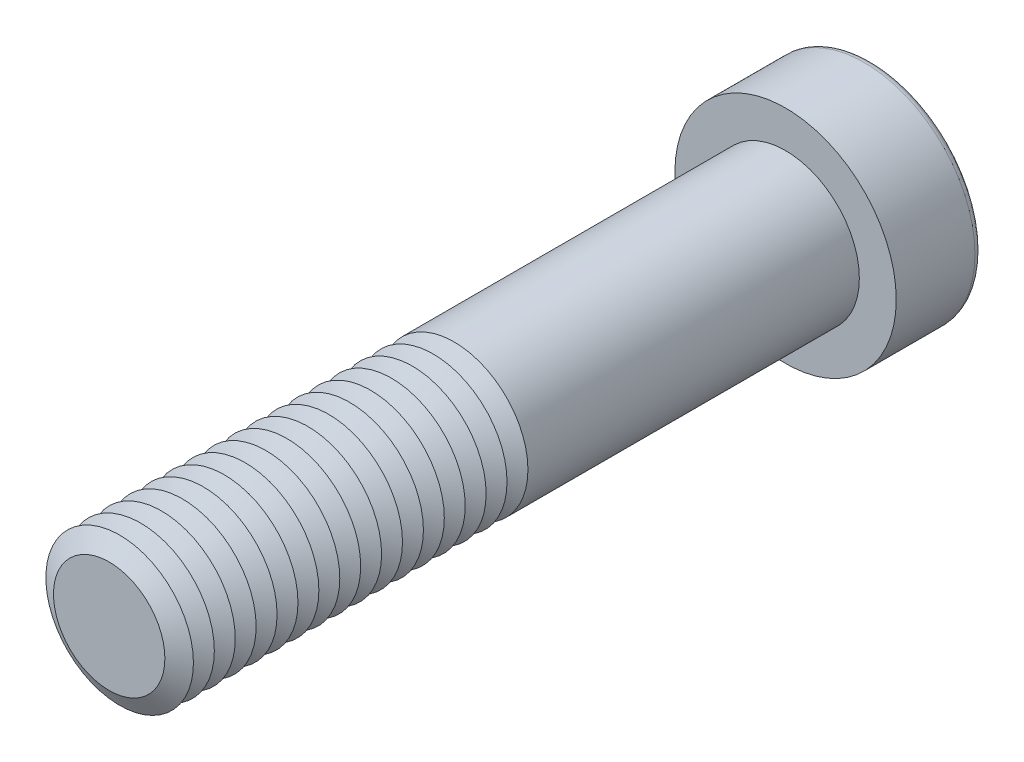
ISO-10303-21;
HEADER;
FILE_DESCRIPTION(('STEP AP214'),'2;1');
FILE_NAME('part.step','',(''),(''),'','','');
FILE_SCHEMA(('AUTOMOTIVE_DESIGN { 1 0 10303 214 1 1 1 1 }'));
ENDSEC;
DATA;
#1=APPLICATION_CONTEXT('core data for automotive mechanical design processes');
#2=APPLICATION_PROTOCOL_DEFINITION('international standard','automotive_design',2000,#1);
#3=PRODUCT_CONTEXT('',#1,'mechanical');
#4=PRODUCT('Part','Part','',(#3));
#5=PRODUCT_RELATED_PRODUCT_CATEGORY('part','',(#4));
#6=PRODUCT_DEFINITION_FORMATION('','',#4);
#7=PRODUCT_DEFINITION_CONTEXT('part definition',#1,'design');
#8=PRODUCT_DEFINITION('design','',#6,#7);
#9=PRODUCT_DEFINITION_SHAPE('','',#8);
#10=(LENGTH_UNIT() NAMED_UNIT(*) SI_UNIT(.MILLI.,.METRE.));
#11=(NAMED_UNIT(*) PLANE_ANGLE_UNIT() SI_UNIT($,.RADIAN.));
#12=(NAMED_UNIT(*) SI_UNIT($,.STERADIAN.) SOLID_ANGLE_UNIT());
#13=UNCERTAINTY_MEASURE_WITH_UNIT(LENGTH_MEASURE(1.E-05),#10,'distance_accuracy_value','');
#14=(GEOMETRIC_REPRESENTATION_CONTEXT(3) GLOBAL_UNCERTAINTY_ASSIGNED_CONTEXT((#13)) GLOBAL_UNIT_ASSIGNED_CONTEXT((#10,
#11,#12)) REPRESENTATION_CONTEXT('',''));
#15=CARTESIAN_POINT('',(0.,0.,0.));
#16=DIRECTION('',(0.,0.,1.));
#17=DIRECTION('',(1.,0.,0.));
#18=AXIS2_PLACEMENT_3D('',#15,#16,#17);
#19=CARTESIAN_POINT('',(0.,0.,49.05));
#20=DIRECTION('',(0.,0.,1.));
#21=DIRECTION('',(1.,0.,0.));
#22=AXIS2_PLACEMENT_3D('',#19,#20,#21);
#23=CONICAL_SURFACE('',#22,6.,1.0471975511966);
#24=CARTESIAN_POINT('',(0.,0.,48.2));
#25=DIRECTION('',(0.,0.,1.));
#26=DIRECTION('',(1.,0.,0.));
#27=AXIS2_PLACEMENT_3D('',#24,#25,#26);
#28=CIRCLE('',#27,4.52775681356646);
#29=CARTESIAN_POINT('',(4.52775681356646,0.,48.2));
#30=VERTEX_POINT('',#29);
#31=EDGE_CURVE('E313',#30,#30,#28,.T.);
#32=ORIENTED_EDGE('',*,*,#31,.T.);
#33=EDGE_LOOP('',(#32));
#34=FACE_BOUND('',#33,.T.);
#35=CARTESIAN_POINT('',(0.,0.,49.05));
#36=DIRECTION('',(0.,0.,1.));
#37=DIRECTION('',(1.,0.,0.));
#38=AXIS2_PLACEMENT_3D('',#35,#36,#37);
#39=CIRCLE('',#38,6.);
#40=CARTESIAN_POINT('',(6.,0.,49.05));
#41=VERTEX_POINT('',#40);
#42=EDGE_CURVE('E316',#41,#41,#39,.T.);
#43=ORIENTED_EDGE('',*,*,#42,.F.);
#44=EDGE_LOOP('',(#43));
#45=FACE_BOUND('',#44,.T.);
#46=ADVANCED_FACE('F39',(#34,#45),#23,.T.);
#47=CARTESIAN_POINT('',(0.,0.,48.2));
#48=DIRECTION('',(0.,0.,-1.));
#49=DIRECTION('',(-1.,0.,0.));
#50=AXIS2_PLACEMENT_3D('',#47,#48,#49);
#51=CONICAL_SURFACE('',#50,4.52775681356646,1.0471975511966);
#52=CARTESIAN_POINT('',(0.,0.,47.35));
#53=DIRECTION('',(0.,0.,1.));
#54=DIRECTION('',(1.,0.,0.));
#55=AXIS2_PLACEMENT_3D('',#52,#53,#54);
#56=CIRCLE('',#55,6.);
#57=CARTESIAN_POINT('',(6.,0.,47.35));
#58=VERTEX_POINT('',#57);
#59=EDGE_CURVE('E324',#58,#58,#56,.T.);
#60=ORIENTED_EDGE('',*,*,#59,.T.);
#61=EDGE_LOOP('',(#60));
#62=FACE_BOUND('',#61,.T.);
#63=ORIENTED_EDGE('',*,*,#31,.F.);
#64=EDGE_LOOP('',(#63));
#65=FACE_BOUND('',#64,.T.);
#66=ADVANCED_FACE('F244',(#62,#65),#51,.T.);
#67=CARTESIAN_POINT('',(0.,0.,55.));
#68=DIRECTION('',(0.,0.,1.));
#69=DIRECTION('',(1.,0.,0.));
#70=AXIS2_PLACEMENT_3D('',#67,#68,#69);
#71=PLANE('',#70);
#72=CARTESIAN_POINT('',(0.,0.,55.));
#73=DIRECTION('',(0.,0.,1.));
#74=DIRECTION('',(1.,0.,0.));
#75=AXIS2_PLACEMENT_3D('',#72,#73,#74);
#76=CIRCLE('',#75,4.52775681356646);
#77=CARTESIAN_POINT('',(4.52775681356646,0.,55.));
#78=VERTEX_POINT('',#77);
#79=EDGE_CURVE('E173',#78,#78,#76,.T.);
#80=ORIENTED_EDGE('',*,*,#79,.T.);
#81=EDGE_LOOP('',(#80));
#82=FACE_BOUND('',#81,.T.);
#83=ADVANCED_FACE('F250',(#82),#71,.T.);
#84=CARTESIAN_POINT('',(0.,0.,55.));
#85=DIRECTION('',(0.,0.,-1.));
#86=DIRECTION('',(-1.,0.,0.));
#87=AXIS2_PLACEMENT_3D('',#84,#85,#86);
#88=CONICAL_SURFACE('',#87,4.52775681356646,1.0471975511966);
#89=CARTESIAN_POINT('',(0.,0.,54.15));
#90=DIRECTION('',(0.,0.,1.));
#91=DIRECTION('',(1.,0.,0.));
#92=AXIS2_PLACEMENT_3D('',#89,#90,#91);
#93=CIRCLE('',#92,6.);
#94=CARTESIAN_POINT('',(6.,0.,54.15));
#95=VERTEX_POINT('',#94);
#96=EDGE_CURVE('E290',#95,#95,#93,.T.);
#97=ORIENTED_EDGE('',*,*,#96,.T.);
#98=EDGE_LOOP('',(#97));
#99=FACE_BOUND('',#98,.T.);
#100=ORIENTED_EDGE('',*,*,#79,.F.);
#101=EDGE_LOOP('',(#100));
#102=FACE_BOUND('',#101,.T.);
#103=ADVANCED_FACE('F198',(#99,#102),#88,.T.);
#104=CARTESIAN_POINT('',(0.,0.,54.15));
#105=DIRECTION('',(0.,0.,1.));
#106=DIRECTION('',(1.,0.,0.));
#107=AXIS2_PLACEMENT_3D('',#104,#105,#106);
#108=CONICAL_SURFACE('',#107,6.,1.0471975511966);
#109=CARTESIAN_POINT('',(0.,0.,53.3));
#110=DIRECTION('',(0.,0.,1.));
#111=DIRECTION('',(1.,0.,0.));
#112=AXIS2_PLACEMENT_3D('',#109,#110,#111);
#113=CIRCLE('',#112,4.52775681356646);
#114=CARTESIAN_POINT('',(4.52775681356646,0.,53.3));
#115=VERTEX_POINT('',#114);
#116=EDGE_CURVE('E287',#115,#115,#113,.T.);
#117=ORIENTED_EDGE('',*,*,#116,.T.);
#118=EDGE_LOOP('',(#117));
#119=FACE_BOUND('',#118,.T.);
#120=ORIENTED_EDGE('',*,*,#96,.F.);
#121=EDGE_LOOP('',(#120));
#122=FACE_BOUND('',#121,.T.);
#123=ADVANCED_FACE('F276',(#119,#122),#108,.T.);
#124=CARTESIAN_POINT('',(0.,0.,53.3));
#125=DIRECTION('',(0.,0.,-1.));
#126=DIRECTION('',(-1.,0.,0.));
#127=AXIS2_PLACEMENT_3D('',#124,#125,#126);
#128=CONICAL_SURFACE('',#127,4.52775681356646,1.0471975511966);
#129=CARTESIAN_POINT('',(0.,0.,52.45));
#130=DIRECTION('',(0.,0.,1.));
#131=DIRECTION('',(1.,0.,0.));
#132=AXIS2_PLACEMENT_3D('',#129,#130,#131);
#133=CIRCLE('',#132,6.);
#134=CARTESIAN_POINT('',(6.,0.,52.45));
#135=VERTEX_POINT('',#134);
#136=EDGE_CURVE('E299',#135,#135,#133,.T.);
#137=ORIENTED_EDGE('',*,*,#136,.T.);
#138=EDGE_LOOP('',(#137));
#139=FACE_BOUND('',#138,.T.);
#140=ORIENTED_EDGE('',*,*,#116,.F.);
#141=EDGE_LOOP('',(#140));
#142=FACE_BOUND('',#141,.T.);
#143=ADVANCED_FACE('F273',(#139,#142),#128,.T.);
#144=CARTESIAN_POINT('',(0.,0.,52.45));
#145=DIRECTION('',(0.,0.,1.));
#146=DIRECTION('',(1.,0.,0.));
#147=AXIS2_PLACEMENT_3D('',#144,#145,#146);
#148=CONICAL_SURFACE('',#147,6.,1.0471975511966);
#149=CARTESIAN_POINT('',(0.,0.,51.6));
#150=DIRECTION('',(0.,0.,1.));
#151=DIRECTION('',(1.,0.,0.));
#152=AXIS2_PLACEMENT_3D('',#149,#150,#151);
#153=CIRCLE('',#152,4.52775681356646);
#154=CARTESIAN_POINT('',(4.52775681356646,0.,51.6));
#155=VERTEX_POINT('',#154);
#156=EDGE_CURVE('E292',#155,#155,#153,.T.);
#157=ORIENTED_EDGE('',*,*,#156,.T.);
#158=EDGE_LOOP('',(#157));
#159=FACE_BOUND('',#158,.T.);
#160=ORIENTED_EDGE('',*,*,#136,.F.);
#161=EDGE_LOOP('',(#160));
#162=FACE_BOUND('',#161,.T.);
#163=ADVANCED_FACE('F269',(#159,#162),#148,.T.);
#164=CARTESIAN_POINT('',(0.,0.,51.6));
#165=DIRECTION('',(0.,0.,-1.));
#166=DIRECTION('',(-1.,0.,0.));
#167=AXIS2_PLACEMENT_3D('',#164,#165,#166);
#168=CONICAL_SURFACE('',#167,4.52775681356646,1.0471975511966);
#169=CARTESIAN_POINT('',(0.,0.,50.75));
#170=DIRECTION('',(0.,0.,1.));
#171=DIRECTION('',(1.,0.,0.));
#172=AXIS2_PLACEMENT_3D('',#169,#170,#171);
#173=CIRCLE('',#172,6.);
#174=CARTESIAN_POINT('',(6.,0.,50.75));
#175=VERTEX_POINT('',#174);
#176=EDGE_CURVE('E309',#175,#175,#173,.T.);
#177=ORIENTED_EDGE('',*,*,#176,.T.);
#178=EDGE_LOOP('',(#177));
#179=FACE_BOUND('',#178,.T.);
#180=ORIENTED_EDGE('',*,*,#156,.F.);
#181=EDGE_LOOP('',(#180));
#182=FACE_BOUND('',#181,.T.);
#183=ADVANCED_FACE('F265',(#179,#182),#168,.T.);
#184=CARTESIAN_POINT('',(0.,0.,50.75));
#185=DIRECTION('',(0.,0.,1.));
#186=DIRECTION('',(1.,0.,0.));
#187=AXIS2_PLACEMENT_3D('',#184,#185,#186);
#188=CONICAL_SURFACE('',#187,6.,1.0471975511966);
#189=CARTESIAN_POINT('',(0.,0.,49.9));
#190=DIRECTION('',(0.,0.,1.));
#191=DIRECTION('',(1.,0.,0.));
#192=AXIS2_PLACEMENT_3D('',#189,#190,#191);
#193=CIRCLE('',#192,4.52775681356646);
#194=CARTESIAN_POINT('',(4.52775681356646,0.,49.9));
#195=VERTEX_POINT('',#194);
#196=EDGE_CURVE('E305',#195,#195,#193,.T.);
#197=ORIENTED_EDGE('',*,*,#196,.T.);
#198=EDGE_LOOP('',(#197));
#199=FACE_BOUND('',#198,.T.);
#200=ORIENTED_EDGE('',*,*,#176,.F.);
#201=EDGE_LOOP('',(#200));
#202=FACE_BOUND('',#201,.T.);
#203=ADVANCED_FACE('F261',(#199,#202),#188,.T.);
#204=CARTESIAN_POINT('',(0.,0.,49.9));
#205=DIRECTION('',(0.,0.,-1.));
#206=DIRECTION('',(-1.,0.,0.));
#207=AXIS2_PLACEMENT_3D('',#204,#205,#206);
#208=CONICAL_SURFACE('',#207,4.52775681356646,1.0471975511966);
#209=ORIENTED_EDGE('',*,*,#42,.T.);
#210=EDGE_LOOP('',(#209));
#211=FACE_BOUND('',#210,.T.);
#212=ORIENTED_EDGE('',*,*,#196,.F.);
#213=EDGE_LOOP('',(#212));
#214=FACE_BOUND('',#213,.T.);
#215=ADVANCED_FACE('F257',(#211,#214),#208,.T.);
#216=CARTESIAN_POINT('',(0.,0.,47.35));
#217=DIRECTION('',(0.,0.,1.));
#218=DIRECTION('',(1.,0.,0.));
#219=AXIS2_PLACEMENT_3D('',#216,#217,#218);
#220=CONICAL_SURFACE('',#219,6.,1.0471975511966);
#221=CARTESIAN_POINT('',(0.,0.,46.5));
#222=DIRECTION('',(0.,0.,1.));
#223=DIRECTION('',(1.,0.,0.));
#224=AXIS2_PLACEMENT_3D('',#221,#222,#223);
#225=CIRCLE('',#224,4.52775681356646);
#226=CARTESIAN_POINT('',(4.52775681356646,0.,46.5));
#227=VERTEX_POINT('',#226);
#228=EDGE_CURVE('E320',#227,#227,#225,.T.);
#229=ORIENTED_EDGE('',*,*,#228,.T.);
#230=EDGE_LOOP('',(#229));
#231=FACE_BOUND('',#230,.T.);
#232=ORIENTED_EDGE('',*,*,#59,.F.);
#233=EDGE_LOOP('',(#232));
#234=FACE_BOUND('',#233,.T.);
#235=ADVANCED_FACE('F260',(#231,#234),#220,.T.);
#236=CARTESIAN_POINT('',(0.,0.,46.5));
#237=DIRECTION('',(0.,0.,-1.));
#238=DIRECTION('',(-1.,0.,0.));
#239=AXIS2_PLACEMENT_3D('',#236,#237,#238);
#240=CONICAL_SURFACE('',#239,4.52775681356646,1.0471975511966);
#241=CARTESIAN_POINT('',(0.,0.,45.65));
#242=DIRECTION('',(0.,0.,1.));
#243=DIRECTION('',(1.,0.,0.));
#244=AXIS2_PLACEMENT_3D('',#241,#242,#243);
#245=CIRCLE('',#244,6.);
#246=CARTESIAN_POINT('',(6.,0.,45.65));
#247=VERTEX_POINT('',#246);
#248=EDGE_CURVE('E332',#247,#247,#245,.T.);
#249=ORIENTED_EDGE('',*,*,#248,.T.);
#250=EDGE_LOOP('',(#249));
#251=FACE_BOUND('',#250,.T.);
#252=ORIENTED_EDGE('',*,*,#228,.F.);
#253=EDGE_LOOP('',(#252));
#254=FACE_BOUND('',#253,.T.);
#255=ADVANCED_FACE('F513',(#251,#254),#240,.T.);
#256=CARTESIAN_POINT('',(0.,0.,45.65));
#257=DIRECTION('',(0.,0.,1.));
#258=DIRECTION('',(1.,0.,0.));
#259=AXIS2_PLACEMENT_3D('',#256,#257,#258);
#260=CONICAL_SURFACE('',#259,6.,1.0471975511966);
#261=CARTESIAN_POINT('',(0.,0.,44.8));
#262=DIRECTION('',(0.,0.,1.));
#263=DIRECTION('',(1.,0.,0.));
#264=AXIS2_PLACEMENT_3D('',#261,#262,#263);
#265=CIRCLE('',#264,4.52775681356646);
#266=CARTESIAN_POINT('',(4.52775681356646,0.,44.8));
#267=VERTEX_POINT('',#266);
#268=EDGE_CURVE('E328',#267,#267,#265,.T.);
#269=ORIENTED_EDGE('',*,*,#268,.T.);
#270=EDGE_LOOP('',(#269));
#271=FACE_BOUND('',#270,.T.);
#272=ORIENTED_EDGE('',*,*,#248,.F.);
#273=EDGE_LOOP('',(#272));
#274=FACE_BOUND('',#273,.T.);
#275=ADVANCED_FACE('F509',(#271,#274),#260,.T.);
#276=CARTESIAN_POINT('',(0.,0.,44.8));
#277=DIRECTION('',(0.,0.,-1.));
#278=DIRECTION('',(-1.,0.,0.));
#279=AXIS2_PLACEMENT_3D('',#276,#277,#278);
#280=CONICAL_SURFACE('',#279,4.52775681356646,1.0471975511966);
#281=CARTESIAN_POINT('',(0.,0.,43.95));
#282=DIRECTION('',(0.,0.,1.));
#283=DIRECTION('',(1.,0.,0.));
#284=AXIS2_PLACEMENT_3D('',#281,#282,#283);
#285=CIRCLE('',#284,6.);
#286=CARTESIAN_POINT('',(6.,0.,43.95));
#287=VERTEX_POINT('',#286);
#288=EDGE_CURVE('E340',#287,#287,#285,.T.);
#289=ORIENTED_EDGE('',*,*,#288,.T.);
#290=EDGE_LOOP('',(#289));
#291=FACE_BOUND('',#290,.T.);
#292=ORIENTED_EDGE('',*,*,#268,.F.);
#293=EDGE_LOOP('',(#292));
#294=FACE_BOUND('',#293,.T.);
#295=ADVANCED_FACE('F505',(#291,#294),#280,.T.);
#296=CARTESIAN_POINT('',(0.,0.,43.95));
#297=DIRECTION('',(0.,0.,1.));
#298=DIRECTION('',(1.,0.,0.));
#299=AXIS2_PLACEMENT_3D('',#296,#297,#298);
#300=CONICAL_SURFACE('',#299,6.,1.0471975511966);
#301=CARTESIAN_POINT('',(0.,0.,43.1));
#302=DIRECTION('',(0.,0.,1.));
#303=DIRECTION('',(1.,0.,0.));
#304=AXIS2_PLACEMENT_3D('',#301,#302,#303);
#305=CIRCLE('',#304,4.52775681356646);
#306=CARTESIAN_POINT('',(4.52775681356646,0.,43.1));
#307=VERTEX_POINT('',#306);
#308=EDGE_CURVE('E336',#307,#307,#305,.T.);
#309=ORIENTED_EDGE('',*,*,#308,.T.);
#310=EDGE_LOOP('',(#309));
#311=FACE_BOUND('',#310,.T.);
#312=ORIENTED_EDGE('',*,*,#288,.F.);
#313=EDGE_LOOP('',(#312));
#314=FACE_BOUND('',#313,.T.);
#315=ADVANCED_FACE('F501',(#311,#314),#300,.T.);
#316=CARTESIAN_POINT('',(0.,0.,43.1));
#317=DIRECTION('',(0.,0.,-1.));
#318=DIRECTION('',(-1.,0.,0.));
#319=AXIS2_PLACEMENT_3D('',#316,#317,#318);
#320=CONICAL_SURFACE('',#319,4.52775681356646,1.0471975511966);
#321=CARTESIAN_POINT('',(0.,0.,42.25));
#322=DIRECTION('',(0.,0.,1.));
#323=DIRECTION('',(1.,0.,0.));
#324=AXIS2_PLACEMENT_3D('',#321,#322,#323);
#325=CIRCLE('',#324,6.);
#326=CARTESIAN_POINT('',(6.,0.,42.25));
#327=VERTEX_POINT('',#326);
#328=EDGE_CURVE('E348',#327,#327,#325,.T.);
#329=ORIENTED_EDGE('',*,*,#328,.T.);
#330=EDGE_LOOP('',(#329));
#331=FACE_BOUND('',#330,.T.);
#332=ORIENTED_EDGE('',*,*,#308,.F.);
#333=EDGE_LOOP('',(#332));
#334=FACE_BOUND('',#333,.T.);
#335=ADVANCED_FACE('F497',(#331,#334),#320,.T.);
#336=CARTESIAN_POINT('',(0.,0.,42.25));
#337=DIRECTION('',(0.,0.,1.));
#338=DIRECTION('',(1.,0.,0.));
#339=AXIS2_PLACEMENT_3D('',#336,#337,#338);
#340=CONICAL_SURFACE('',#339,6.,1.0471975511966);
#341=CARTESIAN_POINT('',(0.,0.,41.4));
#342=DIRECTION('',(0.,0.,1.));
#343=DIRECTION('',(1.,0.,0.));
#344=AXIS2_PLACEMENT_3D('',#341,#342,#343);
#345=CIRCLE('',#344,4.52775681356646);
#346=CARTESIAN_POINT('',(4.52775681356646,0.,41.4));
#347=VERTEX_POINT('',#346);
#348=EDGE_CURVE('E344',#347,#347,#345,.T.);
#349=ORIENTED_EDGE('',*,*,#348,.T.);
#350=EDGE_LOOP('',(#349));
#351=FACE_BOUND('',#350,.T.);
#352=ORIENTED_EDGE('',*,*,#328,.F.);
#353=EDGE_LOOP('',(#352));
#354=FACE_BOUND('',#353,.T.);
#355=ADVANCED_FACE('F493',(#351,#354),#340,.T.);
#356=CARTESIAN_POINT('',(0.,0.,41.4));
#357=DIRECTION('',(0.,0.,-1.));
#358=DIRECTION('',(-1.,0.,0.));
#359=AXIS2_PLACEMENT_3D('',#356,#357,#358);
#360=CONICAL_SURFACE('',#359,4.52775681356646,1.0471975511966);
#361=CARTESIAN_POINT('',(0.,0.,40.55));
#362=DIRECTION('',(0.,0.,1.));
#363=DIRECTION('',(1.,0.,0.));
#364=AXIS2_PLACEMENT_3D('',#361,#362,#363);
#365=CIRCLE('',#364,6.);
#366=CARTESIAN_POINT('',(6.,0.,40.55));
#367=VERTEX_POINT('',#366);
#368=EDGE_CURVE('E356',#367,#367,#365,.T.);
#369=ORIENTED_EDGE('',*,*,#368,.T.);
#370=EDGE_LOOP('',(#369));
#371=FACE_BOUND('',#370,.T.);
#372=ORIENTED_EDGE('',*,*,#348,.F.);
#373=EDGE_LOOP('',(#372));
#374=FACE_BOUND('',#373,.T.);
#375=ADVANCED_FACE('F489',(#371,#374),#360,.T.);
#376=CARTESIAN_POINT('',(0.,0.,40.55));
#377=DIRECTION('',(0.,0.,1.));
#378=DIRECTION('',(1.,0.,0.));
#379=AXIS2_PLACEMENT_3D('',#376,#377,#378);
#380=CONICAL_SURFACE('',#379,6.,1.0471975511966);
#381=CARTESIAN_POINT('',(0.,0.,39.7));
#382=DIRECTION('',(0.,0.,1.));
#383=DIRECTION('',(1.,0.,0.));
#384=AXIS2_PLACEMENT_3D('',#381,#382,#383);
#385=CIRCLE('',#384,4.52775681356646);
#386=CARTESIAN_POINT('',(4.52775681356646,0.,39.7));
#387=VERTEX_POINT('',#386);
#388=EDGE_CURVE('E352',#387,#387,#385,.T.);
#389=ORIENTED_EDGE('',*,*,#388,.T.);
#390=EDGE_LOOP('',(#389));
#391=FACE_BOUND('',#390,.T.);
#392=ORIENTED_EDGE('',*,*,#368,.F.);
#393=EDGE_LOOP('',(#392));
#394=FACE_BOUND('',#393,.T.);
#395=ADVANCED_FACE('F485',(#391,#394),#380,.T.);
#396=CARTESIAN_POINT('',(0.,0.,39.7));
#397=DIRECTION('',(0.,0.,-1.));
#398=DIRECTION('',(-1.,0.,0.));
#399=AXIS2_PLACEMENT_3D('',#396,#397,#398);
#400=CONICAL_SURFACE('',#399,4.52775681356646,1.0471975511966);
#401=CARTESIAN_POINT('',(0.,0.,38.85));
#402=DIRECTION('',(0.,0.,1.));
#403=DIRECTION('',(1.,0.,0.));
#404=AXIS2_PLACEMENT_3D('',#401,#402,#403);
#405=CIRCLE('',#404,6.);
#406=CARTESIAN_POINT('',(6.,0.,38.85));
#407=VERTEX_POINT('',#406);
#408=EDGE_CURVE('E364',#407,#407,#405,.T.);
#409=ORIENTED_EDGE('',*,*,#408,.T.);
#410=EDGE_LOOP('',(#409));
#411=FACE_BOUND('',#410,.T.);
#412=ORIENTED_EDGE('',*,*,#388,.F.);
#413=EDGE_LOOP('',(#412));
#414=FACE_BOUND('',#413,.T.);
#415=ADVANCED_FACE('F481',(#411,#414),#400,.T.);
#416=CARTESIAN_POINT('',(0.,0.,38.85));
#417=DIRECTION('',(0.,0.,1.));
#418=DIRECTION('',(1.,0.,0.));
#419=AXIS2_PLACEMENT_3D('',#416,#417,#418);
#420=CONICAL_SURFACE('',#419,6.,1.0471975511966);
#421=CARTESIAN_POINT('',(0.,0.,38.));
#422=DIRECTION('',(0.,0.,1.));
#423=DIRECTION('',(1.,0.,0.));
#424=AXIS2_PLACEMENT_3D('',#421,#422,#423);
#425=CIRCLE('',#424,4.52775681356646);
#426=CARTESIAN_POINT('',(4.52775681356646,0.,38.));
#427=VERTEX_POINT('',#426);
#428=EDGE_CURVE('E360',#427,#427,#425,.T.);
#429=ORIENTED_EDGE('',*,*,#428,.T.);
#430=EDGE_LOOP('',(#429));
#431=FACE_BOUND('',#430,.T.);
#432=ORIENTED_EDGE('',*,*,#408,.F.);
#433=EDGE_LOOP('',(#432));
#434=FACE_BOUND('',#433,.T.);
#435=ADVANCED_FACE('F477',(#431,#434),#420,.T.);
#436=CARTESIAN_POINT('',(0.,0.,38.));
#437=DIRECTION('',(0.,0.,-1.));
#438=DIRECTION('',(-1.,0.,0.));
#439=AXIS2_PLACEMENT_3D('',#436,#437,#438);
#440=CONICAL_SURFACE('',#439,4.52775681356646,1.0471975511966);
#441=CARTESIAN_POINT('',(0.,0.,37.15));
#442=DIRECTION('',(0.,0.,1.));
#443=DIRECTION('',(1.,0.,0.));
#444=AXIS2_PLACEMENT_3D('',#441,#442,#443);
#445=CIRCLE('',#444,6.);
#446=CARTESIAN_POINT('',(6.,0.,37.15));
#447=VERTEX_POINT('',#446);
#448=EDGE_CURVE('E372',#447,#447,#445,.T.);
#449=ORIENTED_EDGE('',*,*,#448,.T.);
#450=EDGE_LOOP('',(#449));
#451=FACE_BOUND('',#450,.T.);
#452=ORIENTED_EDGE('',*,*,#428,.F.);
#453=EDGE_LOOP('',(#452));
#454=FACE_BOUND('',#453,.T.);
#455=ADVANCED_FACE('F473',(#451,#454),#440,.T.);
#456=CARTESIAN_POINT('',(0.,0.,37.15));
#457=DIRECTION('',(0.,0.,1.));
#458=DIRECTION('',(1.,0.,0.));
#459=AXIS2_PLACEMENT_3D('',#456,#457,#458);
#460=CONICAL_SURFACE('',#459,6.,1.0471975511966);
#461=CARTESIAN_POINT('',(0.,0.,36.3));
#462=DIRECTION('',(0.,0.,1.));
#463=DIRECTION('',(1.,0.,0.));
#464=AXIS2_PLACEMENT_3D('',#461,#462,#463);
#465=CIRCLE('',#464,4.52775681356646);
#466=CARTESIAN_POINT('',(4.52775681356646,0.,36.3));
#467=VERTEX_POINT('',#466);
#468=EDGE_CURVE('E368',#467,#467,#465,.T.);
#469=ORIENTED_EDGE('',*,*,#468,.T.);
#470=EDGE_LOOP('',(#469));
#471=FACE_BOUND('',#470,.T.);
#472=ORIENTED_EDGE('',*,*,#448,.F.);
#473=EDGE_LOOP('',(#472));
#474=FACE_BOUND('',#473,.T.);
#475=ADVANCED_FACE('F469',(#471,#474),#460,.T.);
#476=CARTESIAN_POINT('',(0.,0.,36.3));
#477=DIRECTION('',(0.,0.,-1.));
#478=DIRECTION('',(-1.,0.,0.));
#479=AXIS2_PLACEMENT_3D('',#476,#477,#478);
#480=CONICAL_SURFACE('',#479,4.52775681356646,1.0471975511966);
#481=CARTESIAN_POINT('',(0.,0.,35.45));
#482=DIRECTION('',(0.,0.,1.));
#483=DIRECTION('',(1.,0.,0.));
#484=AXIS2_PLACEMENT_3D('',#481,#482,#483);
#485=CIRCLE('',#484,6.);
#486=CARTESIAN_POINT('',(6.,0.,35.45));
#487=VERTEX_POINT('',#486);
#488=EDGE_CURVE('E380',#487,#487,#485,.T.);
#489=ORIENTED_EDGE('',*,*,#488,.T.);
#490=EDGE_LOOP('',(#489));
#491=FACE_BOUND('',#490,.T.);
#492=ORIENTED_EDGE('',*,*,#468,.F.);
#493=EDGE_LOOP('',(#492));
#494=FACE_BOUND('',#493,.T.);
#495=ADVANCED_FACE('F465',(#491,#494),#480,.T.);
#496=CARTESIAN_POINT('',(0.,0.,35.45));
#497=DIRECTION('',(0.,0.,1.));
#498=DIRECTION('',(1.,0.,0.));
#499=AXIS2_PLACEMENT_3D('',#496,#497,#498);
#500=CONICAL_SURFACE('',#499,6.,1.0471975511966);
#501=CARTESIAN_POINT('',(0.,0.,34.6));
#502=DIRECTION('',(0.,0.,1.));
#503=DIRECTION('',(1.,0.,0.));
#504=AXIS2_PLACEMENT_3D('',#501,#502,#503);
#505=CIRCLE('',#504,4.52775681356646);
#506=CARTESIAN_POINT('',(4.52775681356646,0.,34.6));
#507=VERTEX_POINT('',#506);
#508=EDGE_CURVE('E376',#507,#507,#505,.T.);
#509=ORIENTED_EDGE('',*,*,#508,.T.);
#510=EDGE_LOOP('',(#509));
#511=FACE_BOUND('',#510,.T.);
#512=ORIENTED_EDGE('',*,*,#488,.F.);
#513=EDGE_LOOP('',(#512));
#514=FACE_BOUND('',#513,.T.);
#515=ADVANCED_FACE('F461',(#511,#514),#500,.T.);
#516=CARTESIAN_POINT('',(0.,0.,34.6));
#517=DIRECTION('',(0.,0.,-1.));
#518=DIRECTION('',(-1.,0.,0.));
#519=AXIS2_PLACEMENT_3D('',#516,#517,#518);
#520=CONICAL_SURFACE('',#519,4.52775681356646,1.0471975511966);
#521=CARTESIAN_POINT('',(0.,0.,33.75));
#522=DIRECTION('',(0.,0.,1.));
#523=DIRECTION('',(1.,0.,0.));
#524=AXIS2_PLACEMENT_3D('',#521,#522,#523);
#525=CIRCLE('',#524,6.);
#526=CARTESIAN_POINT('',(6.,0.,33.75));
#527=VERTEX_POINT('',#526);
#528=EDGE_CURVE('E388',#527,#527,#525,.T.);
#529=ORIENTED_EDGE('',*,*,#528,.T.);
#530=EDGE_LOOP('',(#529));
#531=FACE_BOUND('',#530,.T.);
#532=ORIENTED_EDGE('',*,*,#508,.F.);
#533=EDGE_LOOP('',(#532));
#534=FACE_BOUND('',#533,.T.);
#535=ADVANCED_FACE('F457',(#531,#534),#520,.T.);
#536=CARTESIAN_POINT('',(0.,0.,33.75));
#537=DIRECTION('',(0.,0.,1.));
#538=DIRECTION('',(1.,0.,0.));
#539=AXIS2_PLACEMENT_3D('',#536,#537,#538);
#540=CONICAL_SURFACE('',#539,6.,1.0471975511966);
#541=CARTESIAN_POINT('',(0.,0.,32.9));
#542=DIRECTION('',(0.,0.,1.));
#543=DIRECTION('',(1.,0.,0.));
#544=AXIS2_PLACEMENT_3D('',#541,#542,#543);
#545=CIRCLE('',#544,4.52775681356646);
#546=CARTESIAN_POINT('',(4.52775681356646,0.,32.9));
#547=VERTEX_POINT('',#546);
#548=EDGE_CURVE('E384',#547,#547,#545,.T.);
#549=ORIENTED_EDGE('',*,*,#548,.T.);
#550=EDGE_LOOP('',(#549));
#551=FACE_BOUND('',#550,.T.);
#552=ORIENTED_EDGE('',*,*,#528,.F.);
#553=EDGE_LOOP('',(#552));
#554=FACE_BOUND('',#553,.T.);
#555=ADVANCED_FACE('F453',(#551,#554),#540,.T.);
#556=CARTESIAN_POINT('',(0.,0.,32.9));
#557=DIRECTION('',(0.,0.,-1.));
#558=DIRECTION('',(-1.,0.,0.));
#559=AXIS2_PLACEMENT_3D('',#556,#557,#558);
#560=CONICAL_SURFACE('',#559,4.52775681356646,1.0471975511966);
#561=CARTESIAN_POINT('',(0.,0.,32.05));
#562=DIRECTION('',(0.,0.,1.));
#563=DIRECTION('',(1.,0.,0.));
#564=AXIS2_PLACEMENT_3D('',#561,#562,#563);
#565=CIRCLE('',#564,6.);
#566=CARTESIAN_POINT('',(6.,0.,32.05));
#567=VERTEX_POINT('',#566);
#568=EDGE_CURVE('E396',#567,#567,#565,.T.);
#569=ORIENTED_EDGE('',*,*,#568,.T.);
#570=EDGE_LOOP('',(#569));
#571=FACE_BOUND('',#570,.T.);
#572=ORIENTED_EDGE('',*,*,#548,.F.);
#573=EDGE_LOOP('',(#572));
#574=FACE_BOUND('',#573,.T.);
#575=ADVANCED_FACE('F449',(#571,#574),#560,.T.);
#576=CARTESIAN_POINT('',(0.,0.,32.05));
#577=DIRECTION('',(0.,0.,1.));
#578=DIRECTION('',(1.,0.,0.));
#579=AXIS2_PLACEMENT_3D('',#576,#577,#578);
#580=CONICAL_SURFACE('',#579,6.,1.0471975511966);
#581=CARTESIAN_POINT('',(0.,0.,31.2));
#582=DIRECTION('',(0.,0.,1.));
#583=DIRECTION('',(1.,0.,0.));
#584=AXIS2_PLACEMENT_3D('',#581,#582,#583);
#585=CIRCLE('',#584,4.52775681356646);
#586=CARTESIAN_POINT('',(4.52775681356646,0.,31.2));
#587=VERTEX_POINT('',#586);
#588=EDGE_CURVE('E392',#587,#587,#585,.T.);
#589=ORIENTED_EDGE('',*,*,#588,.T.);
#590=EDGE_LOOP('',(#589));
#591=FACE_BOUND('',#590,.T.);
#592=ORIENTED_EDGE('',*,*,#568,.F.);
#593=EDGE_LOOP('',(#592));
#594=FACE_BOUND('',#593,.T.);
#595=ADVANCED_FACE('F445',(#591,#594),#580,.T.);
#596=CARTESIAN_POINT('',(0.,0.,31.2));
#597=DIRECTION('',(0.,0.,-1.));
#598=DIRECTION('',(-1.,0.,0.));
#599=AXIS2_PLACEMENT_3D('',#596,#597,#598);
#600=CONICAL_SURFACE('',#599,4.52775681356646,1.0471975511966);
#601=CARTESIAN_POINT('',(0.,0.,30.35));
#602=DIRECTION('',(0.,0.,1.));
#603=DIRECTION('',(1.,0.,0.));
#604=AXIS2_PLACEMENT_3D('',#601,#602,#603);
#605=CIRCLE('',#604,6.);
#606=CARTESIAN_POINT('',(6.,0.,30.35));
#607=VERTEX_POINT('',#606);
#608=EDGE_CURVE('E404',#607,#607,#605,.T.);
#609=ORIENTED_EDGE('',*,*,#608,.T.);
#610=EDGE_LOOP('',(#609));
#611=FACE_BOUND('',#610,.T.);
#612=ORIENTED_EDGE('',*,*,#588,.F.);
#613=EDGE_LOOP('',(#612));
#614=FACE_BOUND('',#613,.T.);
#615=ADVANCED_FACE('F441',(#611,#614),#600,.T.);
#616=CARTESIAN_POINT('',(0.,0.,30.35));
#617=DIRECTION('',(0.,0.,1.));
#618=DIRECTION('',(1.,0.,0.));
#619=AXIS2_PLACEMENT_3D('',#616,#617,#618);
#620=CONICAL_SURFACE('',#619,6.,1.0471975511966);
#621=CARTESIAN_POINT('',(0.,0.,29.5));
#622=DIRECTION('',(0.,0.,1.));
#623=DIRECTION('',(1.,0.,0.));
#624=AXIS2_PLACEMENT_3D('',#621,#622,#623);
#625=CIRCLE('',#624,4.52775681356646);
#626=CARTESIAN_POINT('',(4.52775681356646,0.,29.5));
#627=VERTEX_POINT('',#626);
#628=EDGE_CURVE('E400',#627,#627,#625,.T.);
#629=ORIENTED_EDGE('',*,*,#628,.T.);
#630=EDGE_LOOP('',(#629));
#631=FACE_BOUND('',#630,.T.);
#632=ORIENTED_EDGE('',*,*,#608,.F.);
#633=EDGE_LOOP('',(#632));
#634=FACE_BOUND('',#633,.T.);
#635=ADVANCED_FACE('F436',(#631,#634),#620,.T.);
#636=CARTESIAN_POINT('',(0.,0.,29.5));
#637=DIRECTION('',(0.,0.,-1.));
#638=DIRECTION('',(-1.,0.,0.));
#639=AXIS2_PLACEMENT_3D('',#636,#637,#638);
#640=CONICAL_SURFACE('',#639,4.52775681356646,1.0471975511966);
#641=CARTESIAN_POINT('',(0.,0.,28.65));
#642=DIRECTION('',(0.,0.,1.));
#643=DIRECTION('',(1.,0.,0.));
#644=AXIS2_PLACEMENT_3D('',#641,#642,#643);
#645=CIRCLE('',#644,6.);
#646=CARTESIAN_POINT('',(6.,0.,28.65));
#647=VERTEX_POINT('',#646);
#648=EDGE_CURVE('E416',#647,#647,#645,.T.);
#649=ORIENTED_EDGE('',*,*,#648,.T.);
#650=EDGE_LOOP('',(#649));
#651=FACE_BOUND('',#650,.T.);
#652=ORIENTED_EDGE('',*,*,#628,.F.);
#653=EDGE_LOOP('',(#652));
#654=FACE_BOUND('',#653,.T.);
#655=ADVANCED_FACE('F422',(#651,#654),#640,.T.);
#656=CARTESIAN_POINT('',(0.,0.,28.65));
#657=DIRECTION('',(0.,0.,1.));
#658=DIRECTION('',(1.,0.,0.));
#659=AXIS2_PLACEMENT_3D('',#656,#657,#658);
#660=CONICAL_SURFACE('',#659,6.,1.0471975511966);
#661=CARTESIAN_POINT('',(0.,0.,27.8));
#662=DIRECTION('',(0.,0.,1.));
#663=DIRECTION('',(1.,0.,0.));
#664=AXIS2_PLACEMENT_3D('',#661,#662,#663);
#665=CIRCLE('',#664,4.52775681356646);
#666=CARTESIAN_POINT('',(4.52775681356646,0.,27.8));
#667=VERTEX_POINT('',#666);
#668=EDGE_CURVE('E408',#667,#667,#665,.T.);
#669=ORIENTED_EDGE('',*,*,#668,.T.);
#670=EDGE_LOOP('',(#669));
#671=FACE_BOUND('',#670,.T.);
#672=ORIENTED_EDGE('',*,*,#648,.F.);
#673=EDGE_LOOP('',(#672));
#674=FACE_BOUND('',#673,.T.);
#675=ADVANCED_FACE('F425',(#671,#674),#660,.T.);
#676=CARTESIAN_POINT('',(0.,0.,27.8));
#677=DIRECTION('',(0.,0.,-1.));
#678=DIRECTION('',(-1.,0.,0.));
#679=AXIS2_PLACEMENT_3D('',#676,#677,#678);
#680=CONICAL_SURFACE('',#679,4.52775681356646,1.0471975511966);
#681=CARTESIAN_POINT('',(0.,0.,26.95));
#682=DIRECTION('',(0.,0.,1.));
#683=DIRECTION('',(1.,0.,0.));
#684=AXIS2_PLACEMENT_3D('',#681,#682,#683);
#685=CIRCLE('',#684,6.);
#686=CARTESIAN_POINT('',(6.,0.,26.95));
#687=VERTEX_POINT('',#686);
#688=EDGE_CURVE('E412',#687,#687,#685,.T.);
#689=ORIENTED_EDGE('',*,*,#688,.T.);
#690=EDGE_LOOP('',(#689));
#691=FACE_BOUND('',#690,.T.);
#692=ORIENTED_EDGE('',*,*,#668,.F.);
#693=EDGE_LOOP('',(#692));
#694=FACE_BOUND('',#693,.T.);
#695=ADVANCED_FACE('F427',(#691,#694),#680,.T.);
#696=CARTESIAN_POINT('',(0.,0.,-1.));
#697=DIRECTION('',(0.,0.,-1.));
#698=DIRECTION('',(-1.,0.,0.));
#699=AXIS2_PLACEMENT_3D('',#696,#697,#698);
#700=CONICAL_SURFACE('',#699,4.,1.0471975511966);
#701=CARTESIAN_POINT('',(0.,0.,1.30940107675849));
#702=VERTEX_POINT('',#701);
#703=VERTEX_LOOP('',#702);
#704=FACE_BOUND('',#703,.T.);
#705=CARTESIAN_POINT('',(0.,0.,-1.));
#706=DIRECTION('',(0.,0.,-1.));
#707=DIRECTION('',(-1.,0.,0.));
#708=AXIS2_PLACEMENT_3D('',#705,#706,#707);
#709=CIRCLE('',#708,4.);
#710=CARTESIAN_POINT('',(-3.46410161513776,2.,-1.));
#711=VERTEX_POINT('',#710);
#712=CARTESIAN_POINT('',(0.,4.,-1.));
#713=VERTEX_POINT('',#712);
#714=EDGE_CURVE('E149',#711,#713,#709,.T.);
#715=ORIENTED_EDGE('',*,*,#714,.T.);
#716=CARTESIAN_POINT('',(0.,0.,-1.));
#717=DIRECTION('',(0.,0.,-1.));
#718=DIRECTION('',(-1.,0.,0.));
#719=AXIS2_PLACEMENT_3D('',#716,#717,#718);
#720=CIRCLE('',#719,4.);
#721=CARTESIAN_POINT('',(3.46410161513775,2.,-1.));
#722=VERTEX_POINT('',#721);
#723=EDGE_CURVE('E54',#713,#722,#720,.T.);
#724=ORIENTED_EDGE('',*,*,#723,.T.);
#725=CARTESIAN_POINT('',(3.46410161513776,-2.,-1.));
#726=VERTEX_POINT('',#725);
#727=EDGE_CURVE('E1029',#722,#726,#720,.T.);
#728=ORIENTED_EDGE('',*,*,#727,.T.);
#729=CARTESIAN_POINT('',(0.,-4.,-1.));
#730=VERTEX_POINT('',#729);
#731=EDGE_CURVE('E1027',#726,#730,#720,.T.);
#732=ORIENTED_EDGE('',*,*,#731,.T.);
#733=CARTESIAN_POINT('',(-3.46410161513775,-2.,-1.));
#734=VERTEX_POINT('',#733);
#735=EDGE_CURVE('E1021',#730,#734,#720,.T.);
#736=ORIENTED_EDGE('',*,*,#735,.T.);
#737=EDGE_CURVE('E1019',#734,#711,#720,.T.);
#738=ORIENTED_EDGE('',*,*,#737,.T.);
#739=EDGE_LOOP('',(#715,#724,#728,#732,#736,#738));
#740=FACE_BOUND('',#739,.T.);
#741=ADVANCED_FACE('F200',(#704,#740),#700,.F.);
#742=CARTESIAN_POINT('',(0.,0.,-1.));
#743=DIRECTION('',(0.,0.,-1.));
#744=DIRECTION('',(-1.,0.,0.));
#745=AXIS2_PLACEMENT_3D('',#742,#743,#744);
#746=PLANE('',#745);
#747=ORIENTED_EDGE('',*,*,#723,.F.);
#748=DIRECTION('',(1.,0.,0.));
#749=VECTOR('',#748,1.);
#750=CARTESIAN_POINT('',(-2.3094010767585,4.,-1.));
#751=LINE('',#750,#749);
#752=CARTESIAN_POINT('',(2.3094010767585,4.,-1.));
#753=VERTEX_POINT('',#752);
#754=EDGE_CURVE('E1068',#713,#753,#751,.T.);
#755=ORIENTED_EDGE('',*,*,#754,.T.);
#756=DIRECTION('',(0.5,-0.866025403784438,0.));
#757=VECTOR('',#756,1.);
#758=CARTESIAN_POINT('',(2.3094010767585,4.,-1.));
#759=LINE('',#758,#757);
#760=EDGE_CURVE('E155',#753,#722,#759,.T.);
#761=ORIENTED_EDGE('',*,*,#760,.T.);
#762=EDGE_LOOP('',(#747,#755,#761));
#763=FACE_BOUND('',#762,.T.);
#764=ADVANCED_FACE('F608',(#763),#746,.T.);
#765=ORIENTED_EDGE('',*,*,#727,.F.);
#766=CARTESIAN_POINT('',(4.61880215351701,0.,-1.));
#767=VERTEX_POINT('',#766);
#768=EDGE_CURVE('E1067',#722,#767,#759,.T.);
#769=ORIENTED_EDGE('',*,*,#768,.T.);
#770=DIRECTION('',(-0.5,-0.866025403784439,0.));
#771=VECTOR('',#770,1.);
#772=CARTESIAN_POINT('',(4.61880215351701,0.,-1.));
#773=LINE('',#772,#771);
#774=EDGE_CURVE('E1043',#767,#726,#773,.T.);
#775=ORIENTED_EDGE('',*,*,#774,.T.);
#776=EDGE_LOOP('',(#765,#769,#775));
#777=FACE_BOUND('',#776,.T.);
#778=ADVANCED_FACE('F618',(#777),#746,.T.);
#779=ORIENTED_EDGE('',*,*,#731,.F.);
#780=CARTESIAN_POINT('',(2.3094010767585,-4.,-1.));
#781=VERTEX_POINT('',#780);
#782=EDGE_CURVE('E1045',#726,#781,#773,.T.);
#783=ORIENTED_EDGE('',*,*,#782,.T.);
#784=DIRECTION('',(-1.,0.,0.));
#785=VECTOR('',#784,1.);
#786=CARTESIAN_POINT('',(2.3094010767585,-4.,-1.));
#787=LINE('',#786,#785);
#788=EDGE_CURVE('E993',#781,#730,#787,.T.);
#789=ORIENTED_EDGE('',*,*,#788,.T.);
#790=EDGE_LOOP('',(#779,#783,#789));
#791=FACE_BOUND('',#790,.T.);
#792=ADVANCED_FACE('F628',(#791),#746,.T.);
#793=ORIENTED_EDGE('',*,*,#735,.F.);
#794=CARTESIAN_POINT('',(-2.3094010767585,-4.,-1.));
#795=VERTEX_POINT('',#794);
#796=EDGE_CURVE('E1039',#730,#795,#787,.T.);
#797=ORIENTED_EDGE('',*,*,#796,.T.);
#798=DIRECTION('',(-0.5,0.866025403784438,0.));
#799=VECTOR('',#798,1.);
#800=CARTESIAN_POINT('',(-2.3094010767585,-4.,-1.));
#801=LINE('',#800,#799);
#802=EDGE_CURVE('E1041',#795,#734,#801,.T.);
#803=ORIENTED_EDGE('',*,*,#802,.T.);
#804=EDGE_LOOP('',(#793,#797,#803));
#805=FACE_BOUND('',#804,.T.);
#806=ADVANCED_FACE('F636',(#805),#746,.T.);
#807=ORIENTED_EDGE('',*,*,#737,.F.);
#808=CARTESIAN_POINT('',(-4.61880215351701,0.,-1.));
#809=VERTEX_POINT('',#808);
#810=EDGE_CURVE('E1046',#734,#809,#801,.T.);
#811=ORIENTED_EDGE('',*,*,#810,.T.);
#812=DIRECTION('',(0.5,0.866025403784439,0.));
#813=VECTOR('',#812,1.);
#814=CARTESIAN_POINT('',(-4.61880215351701,0.,-1.));
#815=LINE('',#814,#813);
#816=EDGE_CURVE('E158',#809,#711,#815,.T.);
#817=ORIENTED_EDGE('',*,*,#816,.T.);
#818=EDGE_LOOP('',(#807,#811,#817));
#819=FACE_BOUND('',#818,.T.);
#820=ADVANCED_FACE('F230',(#819),#746,.T.);
#821=ORIENTED_EDGE('',*,*,#714,.F.);
#822=CARTESIAN_POINT('',(-2.3094010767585,4.,-1.));
#823=VERTEX_POINT('',#822);
#824=EDGE_CURVE('E1052',#711,#823,#815,.T.);
#825=ORIENTED_EDGE('',*,*,#824,.T.);
#826=EDGE_CURVE('E1066',#823,#713,#751,.T.);
#827=ORIENTED_EDGE('',*,*,#826,.T.);
#828=EDGE_LOOP('',(#821,#825,#827));
#829=FACE_BOUND('',#828,.T.);
#830=ADVANCED_FACE('F620',(#829),#746,.T.);
#831=CARTESIAN_POINT('',(-2.3094010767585,4.,-1.));
#832=DIRECTION('',(0.,1.,0.));
#833=DIRECTION('',(0.,0.,1.));
#834=AXIS2_PLACEMENT_3D('',#831,#832,#833);
#835=PLANE('',#834);
#836=DIRECTION('',(0.,0.,-1.));
#837=VECTOR('',#836,1.);
#838=CARTESIAN_POINT('',(-2.3094010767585,4.,-1.));
#839=LINE('',#838,#837);
#840=CARTESIAN_POINT('',(-2.3094010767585,4.,-7.));
#841=VERTEX_POINT('',#840);
#842=EDGE_CURVE('E147',#823,#841,#839,.T.);
#843=ORIENTED_EDGE('',*,*,#842,.T.);
#844=CARTESIAN_POINT('',(-6.02881516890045,4.,-7.70103379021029));
#845=CARTESIAN_POINT('',(-5.8481958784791,4.,-7.66071709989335));
#846=CARTESIAN_POINT('',(-5.66746141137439,4.,-7.62090727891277));
#847=CARTESIAN_POINT('',(-5.30570552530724,4.,-7.54257487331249));
#848=CARTESIAN_POINT('',(-5.12468409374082,4.,-7.50405234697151));
#849=CARTESIAN_POINT('',(-4.76212658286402,4.,-7.42853268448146));
#850=CARTESIAN_POINT('',(-4.58059016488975,4.,-7.39153716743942));
#851=CARTESIAN_POINT('',(-4.21713405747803,4.,-7.31948392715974));
#852=CARTESIAN_POINT('',(-4.03521437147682,4.,-7.28442618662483));
#853=CARTESIAN_POINT('',(-3.67250657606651,4.,-7.21700168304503));
#854=CARTESIAN_POINT('',(-3.4917223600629,4.,-7.18461419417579));
#855=CARTESIAN_POINT('',(-3.12965653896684,4.,-7.12275774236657));
#856=CARTESIAN_POINT('',(-2.94837492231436,4.,-7.09328884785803));
#857=CARTESIAN_POINT('',(-2.40374454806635,4.,-7.01026455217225));
#858=CARTESIAN_POINT('',(-2.03952090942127,4.,-6.96207428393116));
#859=CARTESIAN_POINT('',(-1.48950033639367,4.,-6.90518200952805));
#860=CARTESIAN_POINT('',(-1.30450135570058,4.,-6.88873552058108));
#861=CARTESIAN_POINT('',(-0.934053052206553,4.,-6.86198845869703));
#862=CARTESIAN_POINT('',(-0.748603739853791,4.,-6.85168774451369));
#863=CARTESIAN_POINT('',(-0.377528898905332,4.,-6.83783090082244));
#864=CARTESIAN_POINT('',(-0.191903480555,4.,-6.83427186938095));
#865=CARTESIAN_POINT('',(0.179350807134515,4.,-6.83411569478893));
#866=CARTESIAN_POINT('',(0.364979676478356,4.,-6.83751856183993));
#867=CARTESIAN_POINT('',(0.736742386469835,4.,-6.85109802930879));
#868=CARTESIAN_POINT('',(0.922875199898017,4.,-6.86130219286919));
#869=CARTESIAN_POINT('',(1.29469888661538,4.,-6.8879135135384));
#870=CARTESIAN_POINT('',(1.48038973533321,4.,-6.90432100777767));
#871=CARTESIAN_POINT('',(1.85132520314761,4.,-6.94252995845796));
#872=CARTESIAN_POINT('',(2.036569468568,4.,-6.96433479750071));
#873=CARTESIAN_POINT('',(2.40646407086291,4.,-7.0124559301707));
#874=CARTESIAN_POINT('',(2.59111440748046,4.,-7.03877222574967));
#875=CARTESIAN_POINT('',(2.96467049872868,4.,-7.09583231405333));
#876=CARTESIAN_POINT('',(3.15356118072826,4.,-7.12667393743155));
#877=CARTESIAN_POINT('',(3.53080577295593,4.,-7.19148953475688));
#878=CARTESIAN_POINT('',(3.71915966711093,4.,-7.22546360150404));
#879=CARTESIAN_POINT('',(4.2835627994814,4.,-7.33112271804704));
#880=CARTESIAN_POINT('',(4.65891157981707,4.,-7.40653797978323));
#881=CARTESIAN_POINT('',(5.40835351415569,4.,-7.56376983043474));
#882=CARTESIAN_POINT('',(5.78244627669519,4.,-7.64558825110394));
#883=CARTESIAN_POINT('',(6.52968076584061,4.,-7.81348272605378));
#884=CARTESIAN_POINT('',(6.90282246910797,4.,-7.89955888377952));
#885=CARTESIAN_POINT('',(7.64386653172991,4.,-8.07356157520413));
#886=CARTESIAN_POINT('',(8.01177724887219,4.,-8.16145269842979));
#887=CARTESIAN_POINT('',(8.74711499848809,4.,-8.33926751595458));
#888=CARTESIAN_POINT('',(9.11454201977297,4.,-8.42919125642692));
#889=CARTESIAN_POINT('',(9.84851788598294,4.,-8.61039317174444));
#890=CARTESIAN_POINT('',(10.2150672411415,4.,-8.70166928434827));
#891=CARTESIAN_POINT('',(10.9478692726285,4.,-8.88534974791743));
#892=CARTESIAN_POINT('',(11.3141219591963,4.,-8.97775405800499));
#893=CARTESIAN_POINT('',(11.6802738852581,4.,-9.07055157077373));
#894=B_SPLINE_CURVE_WITH_KNOTS('',3,(#844,#845,#846,#847,#848,#849,#850,#851,#852,#853,#854,
#855,#856,#857,#858,#859,#860,#861,#862,#863,#864,#865,#866,#867,#868,#869,#870,#871,#872,#873,
#874,#875,#876,#877,#878,#879,#880,#881,#882,#883,#884,#885,#886,#887,#888,#889,#890,#891,#892,
#893),.UNSPECIFIED.,.F.,.F.,(4,2,2,2,2,2,2,2,2,2,2,2,2,2,2,2,2,2,2,2,2,2,2,2,4),(0.,
0.555194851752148,1.11041480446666,1.6662090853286,2.22199840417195,2.77296094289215,
3.32393639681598,4.42561440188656,4.98271716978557,5.5398071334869,6.09665724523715,
6.65350817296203,7.2126296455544,7.77178150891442,8.33128469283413,8.89078811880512,
9.46493123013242,10.0390913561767,11.1875388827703,12.3363161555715,13.4851213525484,
14.6199040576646,15.7547125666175,16.8879395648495,18.0211256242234),.UNSPECIFIED.);
#895=CARTESIAN_POINT('',(2.3094010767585,4.,-7.));
#896=VERTEX_POINT('',#895);
#897=EDGE_CURVE('E124',#841,#896,#894,.T.);
#898=ORIENTED_EDGE('',*,*,#897,.T.);
#899=DIRECTION('',(0.,0.,-1.));
#900=VECTOR('',#899,1.);
#901=CARTESIAN_POINT('',(2.3094010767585,4.,-1.));
#902=LINE('',#901,#900);
#903=EDGE_CURVE('E143',#753,#896,#902,.T.);
#904=ORIENTED_EDGE('',*,*,#903,.F.);
#905=ORIENTED_EDGE('',*,*,#754,.F.);
#906=ORIENTED_EDGE('',*,*,#826,.F.);
#907=EDGE_LOOP('',(#843,#898,#904,#905,#906));
#908=FACE_BOUND('',#907,.T.);
#909=ADVANCED_FACE('F141',(#908),#835,.F.);
#910=CARTESIAN_POINT('',(2.3094010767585,4.,-1.));
#911=DIRECTION('',(0.866025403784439,0.5,0.));
#912=DIRECTION('',(-0.5,0.866025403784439,0.));
#913=AXIS2_PLACEMENT_3D('',#910,#911,#912);
#914=PLANE('',#913);
#915=ORIENTED_EDGE('',*,*,#903,.T.);
#916=CARTESIAN_POINT('',(2.30928560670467,4.0002,-7.0000309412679));
#917=CARTESIAN_POINT('',(2.40519879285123,3.83407348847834,-6.97431943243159));
#918=CARTESIAN_POINT('',(2.50128588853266,3.66764575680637,-6.95097756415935));
#919=CARTESIAN_POINT('',(2.69379944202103,3.33420250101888,-6.90996801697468));
#920=CARTESIAN_POINT('',(2.79022602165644,3.16718676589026,-6.89230264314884));
#921=CARTESIAN_POINT('',(2.98283386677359,2.83358019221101,-6.86367744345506));
#922=CARTESIAN_POINT('',(3.07901382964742,2.66699160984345,-6.85268347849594));
#923=CARTESIAN_POINT('',(3.27149641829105,2.33360198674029,-6.83794168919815));
#924=CARTESIAN_POINT('',(3.3677990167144,2.16680099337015,-6.83419246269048));
#925=CARTESIAN_POINT('',(3.56040421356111,1.83319900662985,-6.83419246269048));
#926=CARTESIAN_POINT('',(3.65670681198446,1.66639801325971,-6.83794168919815));
#927=CARTESIAN_POINT('',(3.84918940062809,1.33300839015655,-6.85268347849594));
#928=CARTESIAN_POINT('',(3.94536936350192,1.16641980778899,-6.86367744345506));
#929=CARTESIAN_POINT('',(4.13797720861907,0.832813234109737,-6.89230264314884));
#930=CARTESIAN_POINT('',(4.23440378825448,0.66579749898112,-6.90996801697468));
#931=CARTESIAN_POINT('',(4.42691734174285,0.332354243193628,-6.95097756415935));
#932=CARTESIAN_POINT('',(4.52300443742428,0.165926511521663,-6.97431943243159));
#933=CARTESIAN_POINT('',(4.61891762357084,-0.000199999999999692,-7.0000309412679));
#934=B_SPLINE_CURVE_WITH_KNOTS('',3,(#916,#917,#918,#919,#920,#921,#922,#923,#924,#925,#926,
#927,#928,#929,#930,#931,#932,#933),.UNSPECIFIED.,.F.,.F.,(4,2,2,2,2,2,2,2,4),(0.,
0.580655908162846,1.1615473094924,1.73944052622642,2.31722188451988,2.89500324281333,
3.47289645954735,4.0537878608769,4.63444376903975),.UNSPECIFIED.);
#935=CARTESIAN_POINT('',(4.61880215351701,0.,-7.));
#936=VERTEX_POINT('',#935);
#937=EDGE_CURVE('E11',#896,#936,#934,.T.);
#938=ORIENTED_EDGE('',*,*,#937,.T.);
#939=DIRECTION('',(0.,0.,-1.));
#940=VECTOR('',#939,1.);
#941=CARTESIAN_POINT('',(4.61880215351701,0.,-1.));
#942=LINE('',#941,#940);
#943=EDGE_CURVE('E157',#767,#936,#942,.T.);
#944=ORIENTED_EDGE('',*,*,#943,.F.);
#945=ORIENTED_EDGE('',*,*,#768,.F.);
#946=ORIENTED_EDGE('',*,*,#760,.F.);
#947=EDGE_LOOP('',(#915,#938,#944,#945,#946));
#948=FACE_BOUND('',#947,.T.);
#949=ADVANCED_FACE('F152',(#948),#914,.F.);
#950=CARTESIAN_POINT('',(4.61880215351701,0.,-1.));
#951=DIRECTION('',(0.866025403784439,-0.5,0.));
#952=DIRECTION('',(0.5,0.866025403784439,0.));
#953=AXIS2_PLACEMENT_3D('',#950,#951,#952);
#954=PLANE('',#953);
#955=ORIENTED_EDGE('',*,*,#943,.T.);
#956=CARTESIAN_POINT('',(4.61891762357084,0.00020000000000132,-7.0000309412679));
#957=CARTESIAN_POINT('',(4.52300443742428,-0.165926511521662,-6.97431943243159));
#958=CARTESIAN_POINT('',(4.42691734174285,-0.332354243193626,-6.95097756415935));
#959=CARTESIAN_POINT('',(4.23440378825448,-0.665797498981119,-6.90996801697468));
#960=CARTESIAN_POINT('',(4.13797720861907,-0.832813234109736,-6.89230264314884));
#961=CARTESIAN_POINT('',(3.94536936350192,-1.16641980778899,-6.86367744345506));
#962=CARTESIAN_POINT('',(3.84918940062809,-1.33300839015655,-6.85268347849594));
#963=CARTESIAN_POINT('',(3.65670681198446,-1.66639801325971,-6.83794168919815));
#964=CARTESIAN_POINT('',(3.56040421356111,-1.83319900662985,-6.83419246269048));
#965=CARTESIAN_POINT('',(3.3677990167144,-2.16680099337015,-6.83419246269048));
#966=CARTESIAN_POINT('',(3.27149641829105,-2.33360198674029,-6.83794168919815));
#967=CARTESIAN_POINT('',(3.07901382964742,-2.66699160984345,-6.85268347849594));
#968=CARTESIAN_POINT('',(2.98283386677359,-2.83358019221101,-6.86367744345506));
#969=CARTESIAN_POINT('',(2.79022602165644,-3.16718676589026,-6.89230264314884));
#970=CARTESIAN_POINT('',(2.69379944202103,-3.33420250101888,-6.90996801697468));
#971=CARTESIAN_POINT('',(2.50128588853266,-3.66764575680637,-6.95097756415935));
#972=CARTESIAN_POINT('',(2.40519879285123,-3.83407348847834,-6.97431943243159));
#973=CARTESIAN_POINT('',(2.30928560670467,-4.0002,-7.0000309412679));
#974=B_SPLINE_CURVE_WITH_KNOTS('',3,(#956,#957,#958,#959,#960,#961,#962,#963,#964,#965,#966,
#967,#968,#969,#970,#971,#972,#973),.UNSPECIFIED.,.F.,.F.,(4,2,2,2,2,2,2,2,4),(0.,
0.580655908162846,1.1615473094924,1.73944052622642,2.31722188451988,2.89500324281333,
3.47289645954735,4.0537878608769,4.63444376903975),.UNSPECIFIED.);
#975=CARTESIAN_POINT('',(2.3094010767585,-4.,-7.));
#976=VERTEX_POINT('',#975);
#977=EDGE_CURVE('E172',#936,#976,#974,.T.);
#978=ORIENTED_EDGE('',*,*,#977,.T.);
#979=DIRECTION('',(0.,0.,-1.));
#980=VECTOR('',#979,1.);
#981=CARTESIAN_POINT('',(2.3094010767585,-4.,-1.));
#982=LINE('',#981,#980);
#983=EDGE_CURVE('E988',#781,#976,#982,.T.);
#984=ORIENTED_EDGE('',*,*,#983,.F.);
#985=ORIENTED_EDGE('',*,*,#782,.F.);
#986=ORIENTED_EDGE('',*,*,#774,.F.);
#987=EDGE_LOOP('',(#955,#978,#984,#985,#986));
#988=FACE_BOUND('',#987,.T.);
#989=ADVANCED_FACE('F190',(#988),#954,.F.);
#990=CARTESIAN_POINT('',(2.3094010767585,-4.,-1.));
#991=DIRECTION('',(0.,-1.,0.));
#992=DIRECTION('',(0.,0.,-1.));
#993=AXIS2_PLACEMENT_3D('',#990,#991,#992);
#994=PLANE('',#993);
#995=ORIENTED_EDGE('',*,*,#983,.T.);
#996=CARTESIAN_POINT('',(-6.02881516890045,-4.,-7.70103379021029));
#997=CARTESIAN_POINT('',(-5.8481958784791,-4.,-7.66071709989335));
#998=CARTESIAN_POINT('',(-5.66746141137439,-4.,-7.62090727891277));
#999=CARTESIAN_POINT('',(-5.30570552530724,-4.,-7.54257487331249));
#1000=CARTESIAN_POINT('',(-5.12468409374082,-4.,-7.50405234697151));
#1001=CARTESIAN_POINT('',(-4.76212658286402,-4.,-7.42853268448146));
#1002=CARTESIAN_POINT('',(-4.58059016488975,-4.,-7.39153716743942));
#1003=CARTESIAN_POINT('',(-4.21713405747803,-4.,-7.31948392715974));
#1004=CARTESIAN_POINT('',(-4.03521437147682,-4.,-7.28442618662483));
#1005=CARTESIAN_POINT('',(-3.67250657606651,-4.,-7.21700168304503));
#1006=CARTESIAN_POINT('',(-3.49172236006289,-4.,-7.18461419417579));
#1007=CARTESIAN_POINT('',(-3.12965653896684,-4.,-7.12275774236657));
#1008=CARTESIAN_POINT('',(-2.94837492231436,-4.,-7.09328884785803));
#1009=CARTESIAN_POINT('',(-2.40374454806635,-4.,-7.01026455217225));
#1010=CARTESIAN_POINT('',(-2.03952090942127,-4.,-6.96207428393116));
#1011=CARTESIAN_POINT('',(-1.48950033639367,-4.,-6.90518200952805));
#1012=CARTESIAN_POINT('',(-1.30450135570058,-4.,-6.88873552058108));
#1013=CARTESIAN_POINT('',(-0.934053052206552,-4.,-6.86198845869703));
#1014=CARTESIAN_POINT('',(-0.748603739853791,-4.,-6.85168774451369));
#1015=CARTESIAN_POINT('',(-0.377528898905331,-4.,-6.83783090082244));
#1016=CARTESIAN_POINT('',(-0.191903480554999,-4.,-6.83427186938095));
#1017=CARTESIAN_POINT('',(0.179350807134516,-4.,-6.83411569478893));
#1018=CARTESIAN_POINT('',(0.364979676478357,-4.,-6.83751856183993));
#1019=CARTESIAN_POINT('',(0.736742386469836,-4.,-6.85109802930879));
#1020=CARTESIAN_POINT('',(0.922875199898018,-4.,-6.86130219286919));
#1021=CARTESIAN_POINT('',(1.29469888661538,-4.,-6.8879135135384));
#1022=CARTESIAN_POINT('',(1.48038973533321,-4.,-6.90432100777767));
#1023=CARTESIAN_POINT('',(1.85132520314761,-4.,-6.94252995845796));
#1024=CARTESIAN_POINT('',(2.036569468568,-4.,-6.96433479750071));
#1025=CARTESIAN_POINT('',(2.40646407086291,-4.,-7.0124559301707));
#1026=CARTESIAN_POINT('',(2.59111440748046,-4.,-7.03877222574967));
#1027=CARTESIAN_POINT('',(2.96467049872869,-4.,-7.09583231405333));
#1028=CARTESIAN_POINT('',(3.15356118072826,-4.,-7.12667393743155));
#1029=CARTESIAN_POINT('',(3.53080577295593,-4.,-7.19148953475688));
#1030=CARTESIAN_POINT('',(3.71915966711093,-4.,-7.22546360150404));
#1031=CARTESIAN_POINT('',(4.2835627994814,-4.,-7.33112271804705));
#1032=CARTESIAN_POINT('',(4.65891157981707,-4.,-7.40653797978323));
#1033=CARTESIAN_POINT('',(5.40835351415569,-4.,-7.56376983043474));
#1034=CARTESIAN_POINT('',(5.78244627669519,-4.,-7.64558825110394));
#1035=CARTESIAN_POINT('',(6.52968076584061,-4.,-7.81348272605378));
#1036=CARTESIAN_POINT('',(6.90282246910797,-4.,-7.89955888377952));
#1037=CARTESIAN_POINT('',(7.64386653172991,-4.,-8.07356157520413));
#1038=CARTESIAN_POINT('',(8.01177724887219,-4.,-8.16145269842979));
#1039=CARTESIAN_POINT('',(8.74711499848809,-4.,-8.33926751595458));
#1040=CARTESIAN_POINT('',(9.11454201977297,-4.,-8.42919125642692));
#1041=CARTESIAN_POINT('',(9.84851788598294,-4.,-8.61039317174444));
#1042=CARTESIAN_POINT('',(10.2150672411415,-4.,-8.70166928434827));
#1043=CARTESIAN_POINT('',(10.9478692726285,-4.,-8.88534974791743));
#1044=CARTESIAN_POINT('',(11.3141219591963,-4.,-8.97775405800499));
#1045=CARTESIAN_POINT('',(11.6802738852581,-4.,-9.07055157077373));
#1046=B_SPLINE_CURVE_WITH_KNOTS('',3,(#996,#997,#998,#999,#1000,#1001,#1002,#1003,#1004,#1005,
#1006,#1007,#1008,#1009,#1010,#1011,#1012,#1013,#1014,#1015,#1016,#1017,#1018,#1019,#1020,#1021,
#1022,#1023,#1024,#1025,#1026,#1027,#1028,#1029,#1030,#1031,#1032,#1033,#1034,#1035,#1036,#1037,
#1038,#1039,#1040,#1041,#1042,#1043,#1044,#1045),.UNSPECIFIED.,.F.,.F.,(4,2,2,2,2,2,2,2,2,2,2,2,
2,2,2,2,2,2,2,2,2,2,2,2,4),(0.,0.555194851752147,1.11041480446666,1.6662090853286,
2.22199840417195,2.77296094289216,3.32393639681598,4.42561440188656,4.98271716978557,
5.5398071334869,6.09665724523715,6.65350817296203,7.2126296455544,7.77178150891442,
8.33128469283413,8.89078811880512,9.46493123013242,10.0390913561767,11.1875388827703,
12.3363161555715,13.4851213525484,14.6199040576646,15.7547125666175,16.8879395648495,
18.0211256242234),.UNSPECIFIED.);
#1047=CARTESIAN_POINT('',(-2.3094010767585,-4.,-7.));
#1048=VERTEX_POINT('',#1047);
#1049=EDGE_CURVE('E183',#976,#1048,#1046,.F.);
#1050=ORIENTED_EDGE('',*,*,#1049,.T.);
#1051=DIRECTION('',(0.,0.,-1.));
#1052=VECTOR('',#1051,1.);
#1053=CARTESIAN_POINT('',(-2.3094010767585,-4.,-1.));
#1054=LINE('',#1053,#1052);
#1055=EDGE_CURVE('E995',#795,#1048,#1054,.T.);
#1056=ORIENTED_EDGE('',*,*,#1055,.F.);
#1057=ORIENTED_EDGE('',*,*,#796,.F.);
#1058=ORIENTED_EDGE('',*,*,#788,.F.);
#1059=EDGE_LOOP('',(#995,#1050,#1056,#1057,#1058));
#1060=FACE_BOUND('',#1059,.T.);
#1061=ADVANCED_FACE('F233',(#1060),#994,.F.);
#1062=CARTESIAN_POINT('',(-2.3094010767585,-4.,-1.));
#1063=DIRECTION('',(-0.866025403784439,-0.5,0.));
#1064=DIRECTION('',(0.5,-0.866025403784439,0.));
#1065=AXIS2_PLACEMENT_3D('',#1062,#1063,#1064);
#1066=PLANE('',#1065);
#1067=ORIENTED_EDGE('',*,*,#1055,.T.);
#1068=CARTESIAN_POINT('',(-2.30928560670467,-4.0002,-7.0000309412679));
#1069=CARTESIAN_POINT('',(-2.40519879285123,-3.83407348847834,-6.97431943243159));
#1070=CARTESIAN_POINT('',(-2.50128588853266,-3.66764575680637,-6.95097756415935));
#1071=CARTESIAN_POINT('',(-2.69379944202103,-3.33420250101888,-6.90996801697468));
#1072=CARTESIAN_POINT('',(-2.79022602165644,-3.16718676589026,-6.89230264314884));
#1073=CARTESIAN_POINT('',(-2.98283386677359,-2.83358019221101,-6.86367744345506));
#1074=CARTESIAN_POINT('',(-3.07901382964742,-2.66699160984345,-6.85268347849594));
#1075=CARTESIAN_POINT('',(-3.27149641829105,-2.33360198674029,-6.83794168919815));
#1076=CARTESIAN_POINT('',(-3.3677990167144,-2.16680099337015,-6.83419246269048));
#1077=CARTESIAN_POINT('',(-3.56040421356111,-1.83319900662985,-6.83419246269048));
#1078=CARTESIAN_POINT('',(-3.65670681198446,-1.66639801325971,-6.83794168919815));
#1079=CARTESIAN_POINT('',(-3.84918940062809,-1.33300839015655,-6.85268347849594));
#1080=CARTESIAN_POINT('',(-3.94536936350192,-1.16641980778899,-6.86367744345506));
#1081=CARTESIAN_POINT('',(-4.13797720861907,-0.832813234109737,-6.89230264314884));
#1082=CARTESIAN_POINT('',(-4.23440378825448,-0.66579749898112,-6.90996801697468));
#1083=CARTESIAN_POINT('',(-4.42691734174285,-0.332354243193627,-6.95097756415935));
#1084=CARTESIAN_POINT('',(-4.52300443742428,-0.165926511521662,-6.97431943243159));
#1085=CARTESIAN_POINT('',(-4.61891762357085,0.000200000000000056,-7.0000309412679));
#1086=B_SPLINE_CURVE_WITH_KNOTS('',3,(#1068,#1069,#1070,#1071,#1072,#1073,#1074,#1075,#1076,
#1077,#1078,#1079,#1080,#1081,#1082,#1083,#1084,#1085),.UNSPECIFIED.,.F.,.F.,(4,2,2,2,2,2,2,2,
4),(0.,0.580655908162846,1.1615473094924,1.73944052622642,2.31722188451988,2.89500324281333,
3.47289645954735,4.05378786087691,4.63444376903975),.UNSPECIFIED.);
#1087=CARTESIAN_POINT('',(-4.61880215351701,0.,-7.));
#1088=VERTEX_POINT('',#1087);
#1089=EDGE_CURVE('E207',#1048,#1088,#1086,.T.);
#1090=ORIENTED_EDGE('',*,*,#1089,.T.);
#1091=DIRECTION('',(0.,0.,-1.));
#1092=VECTOR('',#1091,1.);
#1093=CARTESIAN_POINT('',(-4.61880215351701,0.,-1.));
#1094=LINE('',#1093,#1092);
#1095=EDGE_CURVE('E999',#809,#1088,#1094,.T.);
#1096=ORIENTED_EDGE('',*,*,#1095,.F.);
#1097=ORIENTED_EDGE('',*,*,#810,.F.);
#1098=ORIENTED_EDGE('',*,*,#802,.F.);
#1099=EDGE_LOOP('',(#1067,#1090,#1096,#1097,#1098));
#1100=FACE_BOUND('',#1099,.T.);
#1101=ADVANCED_FACE('F228',(#1100),#1066,.F.);
#1102=CARTESIAN_POINT('',(-4.61880215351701,0.,-1.));
#1103=DIRECTION('',(-0.866025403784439,0.5,0.));
#1104=DIRECTION('',(-0.5,-0.866025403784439,0.));
#1105=AXIS2_PLACEMENT_3D('',#1102,#1103,#1104);
#1106=PLANE('',#1105);
#1107=ORIENTED_EDGE('',*,*,#1095,.T.);
#1108=CARTESIAN_POINT('',(-4.61891762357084,-0.000200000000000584,-7.0000309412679));
#1109=CARTESIAN_POINT('',(-4.52300443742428,0.165926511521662,-6.97431943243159));
#1110=CARTESIAN_POINT('',(-4.42691734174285,0.332354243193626,-6.95097756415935));
#1111=CARTESIAN_POINT('',(-4.23440378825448,0.66579749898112,-6.90996801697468));
#1112=CARTESIAN_POINT('',(-4.13797720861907,0.832813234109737,-6.89230264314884));
#1113=CARTESIAN_POINT('',(-3.94536936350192,1.16641980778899,-6.86367744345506));
#1114=CARTESIAN_POINT('',(-3.84918940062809,1.33300839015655,-6.85268347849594));
#1115=CARTESIAN_POINT('',(-3.65670681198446,1.66639801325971,-6.83794168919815));
#1116=CARTESIAN_POINT('',(-3.56040421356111,1.83319900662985,-6.83419246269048));
#1117=CARTESIAN_POINT('',(-3.3677990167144,2.16680099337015,-6.83419246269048));
#1118=CARTESIAN_POINT('',(-3.27149641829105,2.33360198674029,-6.83794168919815));
#1119=CARTESIAN_POINT('',(-3.07901382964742,2.66699160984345,-6.85268347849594));
#1120=CARTESIAN_POINT('',(-2.98283386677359,2.83358019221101,-6.86367744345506));
#1121=CARTESIAN_POINT('',(-2.79022602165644,3.16718676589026,-6.89230264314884));
#1122=CARTESIAN_POINT('',(-2.69379944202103,3.33420250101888,-6.90996801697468));
#1123=CARTESIAN_POINT('',(-2.50128588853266,3.66764575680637,-6.95097756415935));
#1124=CARTESIAN_POINT('',(-2.40519879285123,3.83407348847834,-6.97431943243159));
#1125=CARTESIAN_POINT('',(-2.30928560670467,4.0002,-7.0000309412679));
#1126=B_SPLINE_CURVE_WITH_KNOTS('',3,(#1108,#1109,#1110,#1111,#1112,#1113,#1114,#1115,#1116,
#1117,#1118,#1119,#1120,#1121,#1122,#1123,#1124,#1125),.UNSPECIFIED.,.F.,.F.,(4,2,2,2,2,2,2,2,
4),(0.,0.580655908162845,1.1615473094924,1.73944052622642,2.31722188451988,2.89500324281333,
3.47289645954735,4.05378786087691,4.63444376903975),.UNSPECIFIED.);
#1127=EDGE_CURVE('E150',#1088,#841,#1126,.T.);
#1128=ORIENTED_EDGE('',*,*,#1127,.T.);
#1129=ORIENTED_EDGE('',*,*,#842,.F.);
#1130=ORIENTED_EDGE('',*,*,#824,.F.);
#1131=ORIENTED_EDGE('',*,*,#816,.F.);
#1132=EDGE_LOOP('',(#1107,#1128,#1129,#1130,#1131));
#1133=FACE_BOUND('',#1132,.T.);
#1134=ADVANCED_FACE('F196',(#1133),#1106,.F.);
#1135=CARTESIAN_POINT('',(0.,0.,-7.));
#1136=DIRECTION('',(0.,0.,-1.));
#1137=DIRECTION('',(-1.,0.,0.));
#1138=AXIS2_PLACEMENT_3D('',#1135,#1136,#1137);
#1139=CONICAL_SURFACE('',#1138,4.61880215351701,1.30899693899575);
#1140=CARTESIAN_POINT('',(0.,0.,-7.));
#1141=DIRECTION('',(0.,0.,-1.));
#1142=DIRECTION('',(-1.,0.,0.));
#1143=AXIS2_PLACEMENT_3D('',#1140,#1141,#1142);
#1144=CIRCLE('',#1143,4.61880215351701);
#1145=EDGE_CURVE('E120',#841,#896,#1144,.T.);
#1146=ORIENTED_EDGE('',*,*,#1145,.T.);
#1147=ORIENTED_EDGE('',*,*,#897,.F.);
#1148=EDGE_LOOP('',(#1146,#1147));
#1149=FACE_BOUND('',#1148,.T.);
#1150=ADVANCED_FACE('F122',(#1149),#1139,.F.);
#1151=EDGE_CURVE('E129',#896,#936,#1144,.T.);
#1152=ORIENTED_EDGE('',*,*,#1151,.T.);
#1153=ORIENTED_EDGE('',*,*,#937,.F.);
#1154=EDGE_LOOP('',(#1152,#1153));
#1155=FACE_BOUND('',#1154,.T.);
#1156=ADVANCED_FACE('F133',(#1155),#1139,.F.);
#1157=EDGE_CURVE('E164',#936,#976,#1144,.T.);
#1158=ORIENTED_EDGE('',*,*,#1157,.T.);
#1159=ORIENTED_EDGE('',*,*,#977,.F.);
#1160=EDGE_LOOP('',(#1158,#1159));
#1161=FACE_BOUND('',#1160,.T.);
#1162=ADVANCED_FACE('F701',(#1161),#1139,.F.);
#1163=EDGE_CURVE('E169',#976,#1048,#1144,.T.);
#1164=ORIENTED_EDGE('',*,*,#1163,.T.);
#1165=ORIENTED_EDGE('',*,*,#1049,.F.);
#1166=EDGE_LOOP('',(#1164,#1165));
#1167=FACE_BOUND('',#1166,.T.);
#1168=ADVANCED_FACE('F708',(#1167),#1139,.F.);
#1169=EDGE_CURVE('E67',#1048,#1088,#1144,.T.);
#1170=ORIENTED_EDGE('',*,*,#1169,.T.);
#1171=ORIENTED_EDGE('',*,*,#1089,.F.);
#1172=EDGE_LOOP('',(#1170,#1171));
#1173=FACE_BOUND('',#1172,.T.);
#1174=ADVANCED_FACE('F716',(#1173),#1139,.F.);
#1175=EDGE_CURVE('E60',#1088,#841,#1144,.T.);
#1176=ORIENTED_EDGE('',*,*,#1175,.T.);
#1177=ORIENTED_EDGE('',*,*,#1127,.F.);
#1178=EDGE_LOOP('',(#1176,#1177));
#1179=FACE_BOUND('',#1178,.T.);
#1180=ADVANCED_FACE('F197',(#1179),#1139,.F.);
#1181=CARTESIAN_POINT('',(0.,0.,-7.));
#1182=DIRECTION('',(0.,0.,-1.));
#1183=DIRECTION('',(-1.,0.,0.));
#1184=AXIS2_PLACEMENT_3D('',#1181,#1182,#1183);
#1185=PLANE('',#1184);
#1186=ORIENTED_EDGE('',*,*,#1175,.F.);
#1187=ORIENTED_EDGE('',*,*,#1169,.F.);
#1188=ORIENTED_EDGE('',*,*,#1163,.F.);
#1189=ORIENTED_EDGE('',*,*,#1157,.F.);
#1190=ORIENTED_EDGE('',*,*,#1151,.F.);
#1191=ORIENTED_EDGE('',*,*,#1145,.F.);
#1192=EDGE_LOOP('',(#1186,#1187,#1188,#1189,#1190,#1191));
#1193=FACE_BOUND('',#1192,.T.);
#1194=CARTESIAN_POINT('',(0.,0.,-7.));
#1195=DIRECTION('',(0.,0.,-1.));
#1196=DIRECTION('',(-1.,0.,0.));
#1197=AXIS2_PLACEMENT_3D('',#1194,#1195,#1196);
#1198=CIRCLE('',#1197,8.4);
#1199=CARTESIAN_POINT('',(-8.4,0.,-7.));
#1200=VERTEX_POINT('',#1199);
#1201=EDGE_CURVE('E1012',#1200,#1200,#1198,.T.);
#1202=ORIENTED_EDGE('',*,*,#1201,.T.);
#1203=EDGE_LOOP('',(#1202));
#1204=FACE_BOUND('',#1203,.T.);
#1205=ADVANCED_FACE('F161',(#1193,#1204),#1185,.T.);
#1206=CARTESIAN_POINT('',(0.,0.,-6.4));
#1207=DIRECTION('',(0.,0.,-1.));
#1208=DIRECTION('',(-1.,0.,0.));
#1209=AXIS2_PLACEMENT_3D('',#1206,#1207,#1208);
#1210=TOROIDAL_SURFACE('',#1209,8.4,0.6);
#1211=CARTESIAN_POINT('',(0.,0.,-6.4));
#1212=DIRECTION('',(0.,0.,-1.));
#1213=DIRECTION('',(-1.,0.,0.));
#1214=AXIS2_PLACEMENT_3D('',#1211,#1212,#1213);
#1215=CIRCLE('',#1214,9.);
#1216=CARTESIAN_POINT('',(-9.,0.,-6.4));
#1217=VERTEX_POINT('',#1216);
#1218=EDGE_CURVE('E1016',#1217,#1217,#1215,.F.);
#1219=ORIENTED_EDGE('',*,*,#1218,.F.);
#1220=EDGE_LOOP('',(#1219));
#1221=FACE_BOUND('',#1220,.T.);
#1222=ORIENTED_EDGE('',*,*,#1201,.F.);
#1223=EDGE_LOOP('',(#1222));
#1224=FACE_BOUND('',#1223,.T.);
#1225=ADVANCED_FACE('F41',(#1221,#1224),#1210,.T.);
#1226=CARTESIAN_POINT('',(0.,0.,-7.));
#1227=DIRECTION('',(0.,0.,1.));
#1228=DIRECTION('',(1.,0.,0.));
#1229=AXIS2_PLACEMENT_3D('',#1226,#1227,#1228);
#1230=CYLINDRICAL_SURFACE('',#1229,9.);
#1231=ORIENTED_EDGE('',*,*,#1218,.T.);
#1232=EDGE_LOOP('',(#1231));
#1233=FACE_BOUND('',#1232,.T.);
#1234=CARTESIAN_POINT('',(0.,0.,0.));
#1235=DIRECTION('',(0.,0.,-1.));
#1236=DIRECTION('',(-1.,0.,0.));
#1237=AXIS2_PLACEMENT_3D('',#1234,#1235,#1236);
#1238=CIRCLE('',#1237,9.);
#1239=CARTESIAN_POINT('',(-9.,0.,0.));
#1240=VERTEX_POINT('',#1239);
#1241=EDGE_CURVE('E1004',#1240,#1240,#1238,.T.);
#1242=ORIENTED_EDGE('',*,*,#1241,.T.);
#1243=EDGE_LOOP('',(#1242));
#1244=FACE_BOUND('',#1243,.T.);
#1245=ADVANCED_FACE('F740',(#1233,#1244),#1230,.T.);
#1246=CARTESIAN_POINT('',(0.,0.,0.));
#1247=DIRECTION('',(0.,0.,-1.));
#1248=DIRECTION('',(-1.,0.,0.));
#1249=AXIS2_PLACEMENT_3D('',#1246,#1247,#1248);
#1250=PLANE('',#1249);
#1251=CARTESIAN_POINT('',(0.,0.,0.));
#1252=DIRECTION('',(0.,0.,1.));
#1253=DIRECTION('',(1.,0.,0.));
#1254=AXIS2_PLACEMENT_3D('',#1251,#1252,#1253);
#1255=CIRCLE('',#1254,6.);
#1256=CARTESIAN_POINT('',(6.,0.,0.));
#1257=VERTEX_POINT('',#1256);
#1258=EDGE_CURVE('E1008',#1257,#1257,#1255,.T.);
#1259=ORIENTED_EDGE('',*,*,#1258,.F.);
#1260=EDGE_LOOP('',(#1259));
#1261=FACE_BOUND('',#1260,.T.);
#1262=ORIENTED_EDGE('',*,*,#1241,.F.);
#1263=EDGE_LOOP('',(#1262));
#1264=FACE_BOUND('',#1263,.T.);
#1265=ADVANCED_FACE('F748',(#1261,#1264),#1250,.F.);
#1266=CARTESIAN_POINT('',(0.,0.,55.));
#1267=DIRECTION('',(0.,0.,-1.));
#1268=DIRECTION('',(-1.,0.,0.));
#1269=AXIS2_PLACEMENT_3D('',#1266,#1267,#1268);
#1270=CYLINDRICAL_SURFACE('',#1269,6.);
#1271=ORIENTED_EDGE('',*,*,#1258,.T.);
#1272=EDGE_LOOP('',(#1271));
#1273=FACE_BOUND('',#1272,.T.);
#1274=ORIENTED_EDGE('',*,*,#688,.F.);
#1275=EDGE_LOOP('',(#1274));
#1276=FACE_BOUND('',#1275,.T.);
#1277=ADVANCED_FACE('F757',(#1273,#1276),#1270,.T.);
#1278=CLOSED_SHELL('',(#46,#66,#83,#103,#123,#143,#163,#183,#203,#215,#235,#255,#275,#295,#315,
#335,#355,#375,#395,#415,#435,#455,#475,#495,#515,#535,#555,#575,#595,#615,#635,#655,#675,#695,
#741,#764,#778,#792,#806,#820,#830,#909,#949,#989,#1061,#1101,#1134,#1150,#1156,#1162,#1168,
#1174,#1180,#1205,#1225,#1245,#1265,#1277));
#1279=MANIFOLD_SOLID_BREP('B2',#1278);
#1280=ADVANCED_BREP_SHAPE_REPRESENTATION('',(#18,#1279),#14);
#1281=SHAPE_DEFINITION_REPRESENTATION(#9,#1280);
ENDSEC;
END-ISO-10303-21;
